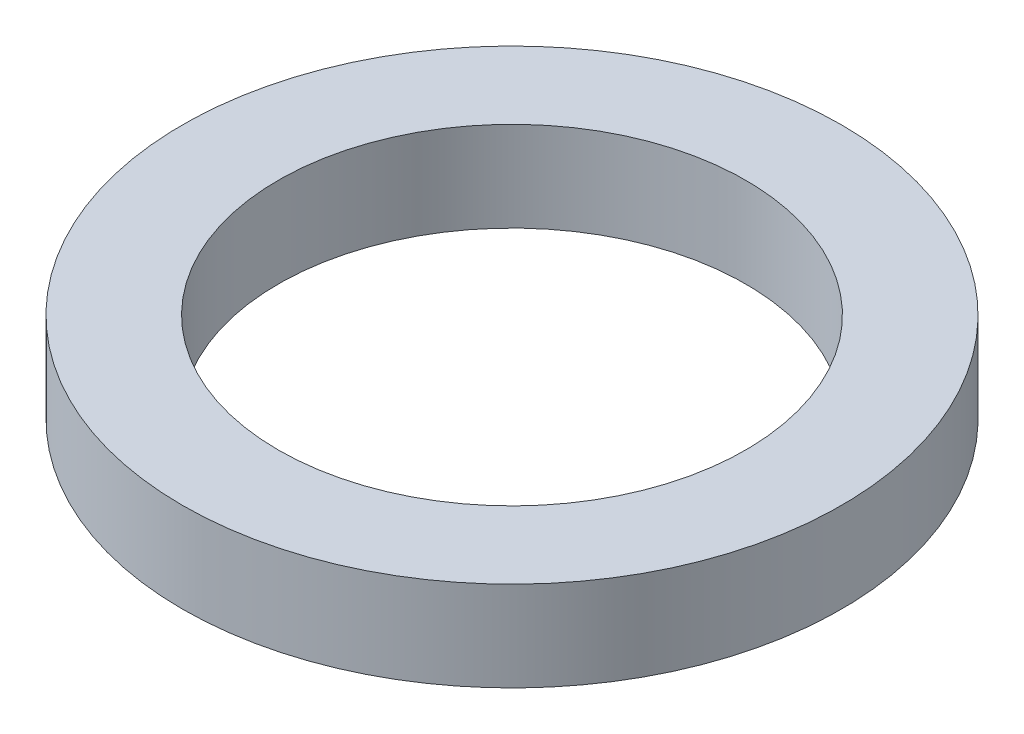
from build123d import *

# Parameters (mm, degrees)
SKIZZE1_R               = 55
SKIZZE1_R_2             = 39
LINEAR_AUSTRAGEN1_DEPTH = 15


with BuildPart() as part:
    # Skizze1 → Linear austragen1 (new body)
    with BuildSketch(Plane(origin=(0, 0, 0), x_dir=(1, 0, 0), z_dir=(0, 1, 0))):
        with Locations(Location((0, 0, 0), (0, 0, 270))):
            Circle(SKIZZE1_R)
        with Locations(Location((0, 0, 0), (0, 0, 270))):
            Circle(SKIZZE1_R_2, mode=Mode.SUBTRACT)
    extrude(amount=LINEAR_AUSTRAGEN1_DEPTH)


solid = part.part
